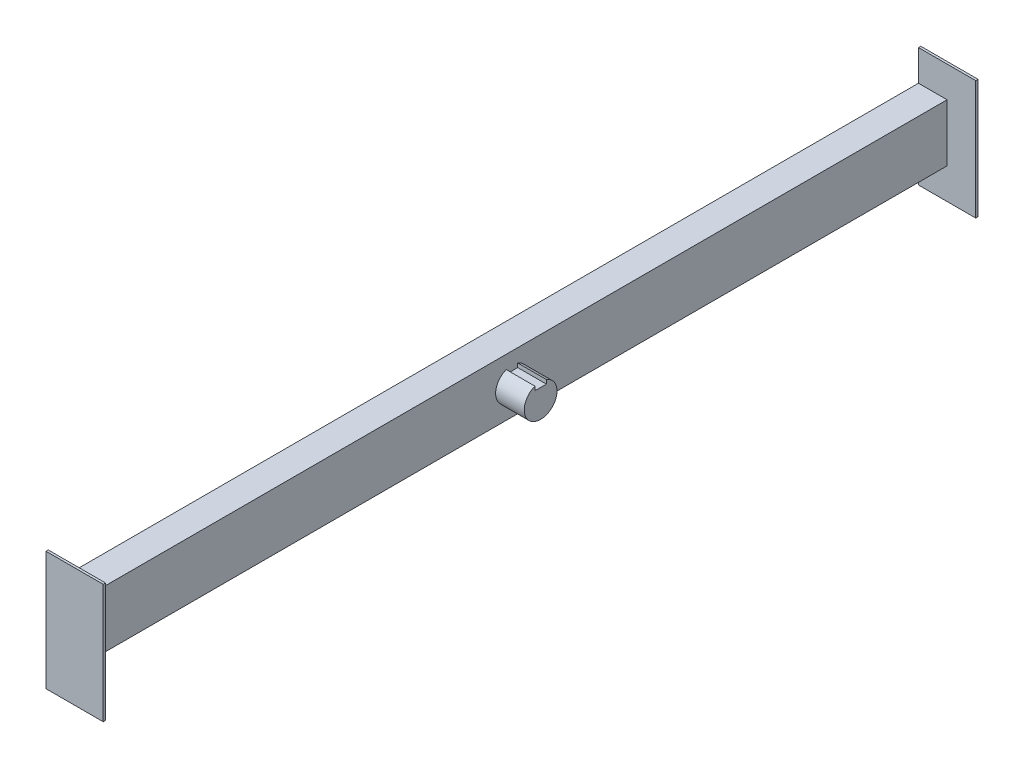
from build123d import *

# Parameters (mm, degrees)
ESQUISSE1_W      = 25
ESQUISSE1_H      = 50
ESQUISSE1_W_2    = 21
ESQUISSE1_H_2    = 46
EXTRUSION1_DEPTH = 760
ESQUISSE2_W      = 50
ESQUISSE2_H      = 104
EXTRUSION2_DEPTH = 2
ESQUISSE5_W      = 50
ESQUISSE5_H      = 104
EXTRUSION3_DEPTH = 2
EXTRUSION4_DEPTH = 25


with BuildPart() as part:
    # Esquisse1 → Extrusion1 (new body)
    with BuildSketch(Plane.XY):
        with Locations((12.5, 25)):
            Rectangle(ESQUISSE1_W, ESQUISSE1_H)
        with Locations((12.5, 25)):
            Rectangle(ESQUISSE1_W_2, ESQUISSE1_H_2, mode=Mode.SUBTRACT)
    extrude(amount=EXTRUSION1_DEPTH)

    # Esquisse2 → Extrusion2 (add)
    with BuildSketch(Plane.XY.offset(760)):
        with Locations((25, 25)):
            Rectangle(ESQUISSE2_W, ESQUISSE2_H)
    extrude(amount=EXTRUSION2_DEPTH)

    # Esquisse5 → Extrusion3 (add)
    with BuildSketch(Plane(origin=(0, 0, 0), x_dir=(-1, 0, 0), z_dir=(0, 0, -1))):
        with Locations((-25, 25)):
            Rectangle(ESQUISSE5_W, ESQUISSE5_H)
    extrude(amount=EXTRUSION3_DEPTH)

    # Esquisse6 → Extrusion4 (add)
    with BuildSketch(Plane(origin=(25, 0, 0), x_dir=(0, 0, -1), z_dir=(1, 0, 0))):
        with BuildLine():
            Line((-385, 38.396679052), (-385, 34.909814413))
            Line((-385, 34.909814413), (-375, 34.909814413))
            Line((-375, 34.909814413), (-375, 38.396679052))
            ThreePointArc((-375, 38.396679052), (-380, 10.700664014), (-385, 38.396679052))
        make_face()
    extrude(amount=EXTRUSION4_DEPTH)


solid = part.part
